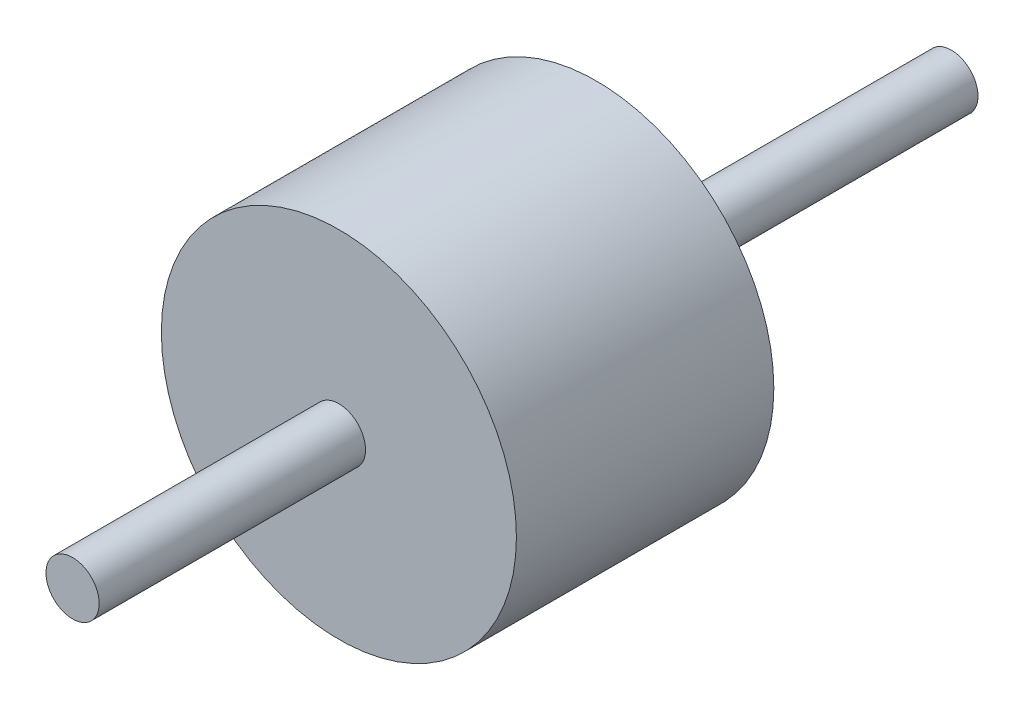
from build123d import *

# Parameters (mm, degrees)
SKETCH_1_R      = 1
EXTRUDE_1_DEPTH = 1.45
SKETCH_2_R      = 0.15
EXTRUDE_2_DEPTH = 1.5
EXTRUDE_START   = 2
SKETCH_3_R      = 0.15
EXTRUDE_3_DEPTH = 2


with BuildPart() as part:
    # Sketch 1 → Extrude 1 (new body)
    with BuildSketch(Plane.XY):
        Circle(SKETCH_1_R)
    extrude(amount=EXTRUDE_1_DEPTH)

    # Sketch 2 → Extrude 2 (add)
    with BuildSketch(Plane.XY.offset(1.45)):
        Circle(SKETCH_2_R)
    extrude(amount=EXTRUDE_2_DEPTH)

    # Sketch 3 → Extrude 3 (add)
    with BuildSketch(Plane(origin=(0, 0, 0), x_dir=(-1, 0, 0), z_dir=(0, 0, -1)).offset(EXTRUDE_START)):
        with Locations(Location((0, 0, 0), (0, 0, 180))):
            Circle(SKETCH_3_R)
    extrude(amount=-EXTRUDE_3_DEPTH)


solid = part.part
